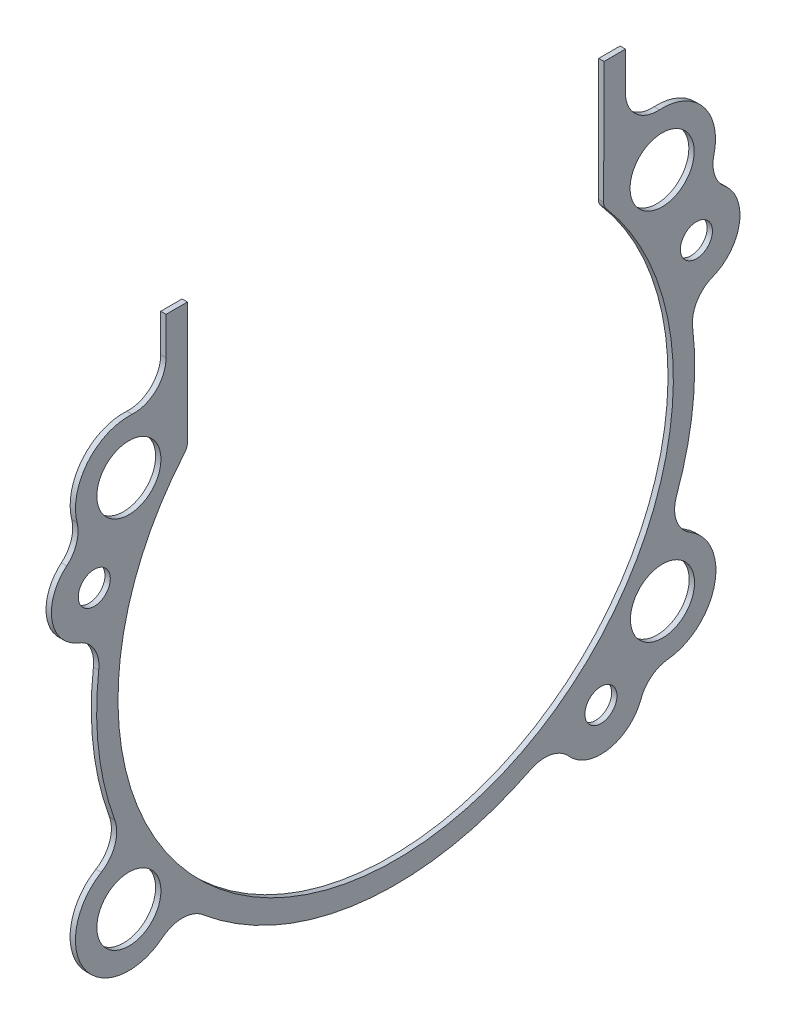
ISO-10303-21;
HEADER;
FILE_DESCRIPTION(('STEP AP214'),'2;1');
FILE_NAME('part.step','',(''),(''),'','','');
FILE_SCHEMA(('AUTOMOTIVE_DESIGN { 1 0 10303 214 1 1 1 1 }'));
ENDSEC;
DATA;
#1=APPLICATION_CONTEXT('core data for automotive mechanical design processes');
#2=APPLICATION_PROTOCOL_DEFINITION('international standard','automotive_design',2000,#1);
#3=PRODUCT_CONTEXT('',#1,'mechanical');
#4=PRODUCT('Part','Part','',(#3));
#5=PRODUCT_RELATED_PRODUCT_CATEGORY('part','',(#4));
#6=PRODUCT_DEFINITION_FORMATION('','',#4);
#7=PRODUCT_DEFINITION_CONTEXT('part definition',#1,'design');
#8=PRODUCT_DEFINITION('design','',#6,#7);
#9=PRODUCT_DEFINITION_SHAPE('','',#8);
#10=(LENGTH_UNIT() NAMED_UNIT(*) SI_UNIT(.MILLI.,.METRE.));
#11=(NAMED_UNIT(*) PLANE_ANGLE_UNIT() SI_UNIT($,.RADIAN.));
#12=(NAMED_UNIT(*) SI_UNIT($,.STERADIAN.) SOLID_ANGLE_UNIT());
#13=UNCERTAINTY_MEASURE_WITH_UNIT(LENGTH_MEASURE(1.E-05),#10,'distance_accuracy_value','');
#14=(GEOMETRIC_REPRESENTATION_CONTEXT(3) GLOBAL_UNCERTAINTY_ASSIGNED_CONTEXT((#13)) GLOBAL_UNIT_ASSIGNED_CONTEXT((#10,
#11,#12)) REPRESENTATION_CONTEXT('',''));
#15=CARTESIAN_POINT('',(0.,0.,0.));
#16=DIRECTION('',(0.,0.,1.));
#17=DIRECTION('',(1.,0.,0.));
#18=AXIS2_PLACEMENT_3D('',#15,#16,#17);
#19=CARTESIAN_POINT('',(-0.25,0.,0.));
#20=DIRECTION('',(1.,0.,0.));
#21=DIRECTION('',(0.,0.,-1.));
#22=AXIS2_PLACEMENT_3D('',#19,#20,#21);
#23=PLANE('',#22);
#24=CARTESIAN_POINT('',(-0.25,10.18,28.22));
#25=DIRECTION('',(1.,0.,0.));
#26=DIRECTION('',(0.,0.,-1.));
#27=AXIS2_PLACEMENT_3D('',#24,#25,#26);
#28=CIRCLE('',#27,1.5);
#29=CARTESIAN_POINT('',(-0.25,10.18,26.72));
#30=VERTEX_POINT('',#29);
#31=EDGE_CURVE('E357',#30,#30,#28,.T.);
#32=ORIENTED_EDGE('',*,*,#31,.T.);
#33=EDGE_LOOP('',(#32));
#34=FACE_BOUND('',#33,.T.);
#35=CARTESIAN_POINT('',(-0.25,-23.04,-19.22));
#36=DIRECTION('',(1.,0.,0.));
#37=DIRECTION('',(0.,0.,-1.));
#38=AXIS2_PLACEMENT_3D('',#35,#36,#37);
#39=CIRCLE('',#38,1.5);
#40=CARTESIAN_POINT('',(-0.25,-23.04,-20.72));
#41=VERTEX_POINT('',#40);
#42=EDGE_CURVE('E360',#41,#41,#39,.T.);
#43=ORIENTED_EDGE('',*,*,#42,.T.);
#44=EDGE_LOOP('',(#43));
#45=FACE_BOUND('',#44,.T.);
#46=CARTESIAN_POINT('',(-0.25,10.18,-28.16019617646));
#47=DIRECTION('',(1.,0.,0.));
#48=DIRECTION('',(0.,0.,-1.));
#49=AXIS2_PLACEMENT_3D('',#46,#47,#48);
#50=CIRCLE('',#49,1.5);
#51=CARTESIAN_POINT('',(-0.25,10.18,-29.66019617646));
#52=VERTEX_POINT('',#51);
#53=EDGE_CURVE('E363',#52,#52,#50,.T.);
#54=ORIENTED_EDGE('',*,*,#53,.T.);
#55=EDGE_LOOP('',(#54));
#56=FACE_BOUND('',#55,.T.);
#57=CARTESIAN_POINT('',(-0.25,-17.49,-24.98));
#58=DIRECTION('',(1.,0.,0.));
#59=DIRECTION('',(0.,0.,-1.));
#60=AXIS2_PLACEMENT_3D('',#57,#58,#59);
#61=CIRCLE('',#60,3.);
#62=CARTESIAN_POINT('',(-0.25,-17.49,-27.98));
#63=VERTEX_POINT('',#62);
#64=EDGE_CURVE('E366',#63,#63,#61,.T.);
#65=ORIENTED_EDGE('',*,*,#64,.T.);
#66=EDGE_LOOP('',(#65));
#67=FACE_BOUND('',#66,.T.);
#68=CARTESIAN_POINT('',(-0.25,-17.49,24.98));
#69=DIRECTION('',(1.,0.,0.));
#70=DIRECTION('',(0.,0.,-1.));
#71=AXIS2_PLACEMENT_3D('',#68,#69,#70);
#72=CIRCLE('',#71,3.);
#73=CARTESIAN_POINT('',(-0.25,-17.49,21.98));
#74=VERTEX_POINT('',#73);
#75=EDGE_CURVE('E369',#74,#74,#72,.T.);
#76=ORIENTED_EDGE('',*,*,#75,.T.);
#77=EDGE_LOOP('',(#76));
#78=FACE_BOUND('',#77,.T.);
#79=CARTESIAN_POINT('',(-0.25,17.49,24.98));
#80=DIRECTION('',(1.,0.,0.));
#81=DIRECTION('',(0.,0.,-1.));
#82=AXIS2_PLACEMENT_3D('',#79,#80,#81);
#83=CIRCLE('',#82,3.);
#84=CARTESIAN_POINT('',(-0.25,17.49,21.98));
#85=VERTEX_POINT('',#84);
#86=EDGE_CURVE('E372',#85,#85,#83,.T.);
#87=ORIENTED_EDGE('',*,*,#86,.T.);
#88=EDGE_LOOP('',(#87));
#89=FACE_BOUND('',#88,.T.);
#90=CARTESIAN_POINT('',(-0.25,17.49,-24.94873879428));
#91=DIRECTION('',(1.,0.,0.));
#92=DIRECTION('',(0.,0.,-1.));
#93=AXIS2_PLACEMENT_3D('',#90,#91,#92);
#94=CIRCLE('',#93,3.);
#95=CARTESIAN_POINT('',(-0.25,17.49,-27.94873879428));
#96=VERTEX_POINT('',#95);
#97=EDGE_CURVE('E375',#96,#96,#94,.T.);
#98=ORIENTED_EDGE('',*,*,#97,.T.);
#99=EDGE_LOOP('',(#98));
#100=FACE_BOUND('',#99,.T.);
#101=DIRECTION('',(0.,0.,1.));
#102=VECTOR('',#101,1.);
#103=CARTESIAN_POINT('',(-0.25,29.,-21.51367783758));
#104=LINE('',#103,#102);
#105=CARTESIAN_POINT('',(-0.25,29.,-21.5136778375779));
#106=VERTEX_POINT('',#105);
#107=CARTESIAN_POINT('',(-0.25,29.,-19.51367783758));
#108=VERTEX_POINT('',#107);
#109=EDGE_CURVE('E270',#106,#108,#104,.T.);
#110=ORIENTED_EDGE('',*,*,#109,.F.);
#111=DIRECTION('',(0.,0.999999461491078,-0.00103779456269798));
#112=VECTOR('',#111,1.);
#113=CARTESIAN_POINT('',(-0.25,25.48,-21.51002479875));
#114=LINE('',#113,#112);
#115=CARTESIAN_POINT('',(-0.25,25.4771524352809,-21.5100239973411));
#116=VERTEX_POINT('',#115);
#117=EDGE_CURVE('E385',#116,#106,#114,.T.);
#118=ORIENTED_EDGE('',*,*,#117,.F.);
#119=CARTESIAN_POINT('',(-0.25,25.48,-24.51002479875));
#120=DIRECTION('',(1.,0.,0.));
#121=DIRECTION('',(0.,0.,-1.));
#122=AXIS2_PLACEMENT_3D('',#119,#120,#121);
#123=CIRCLE('',#122,3.);
#124=CARTESIAN_POINT('',(-0.25,22.4852195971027,-24.6869155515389));
#125=VERTEX_POINT('',#124);
#126=EDGE_CURVE('E388',#116,#125,#123,.T.);
#127=ORIENTED_EDGE('',*,*,#126,.T.);
#128=CARTESIAN_POINT('',(-0.25,17.49207987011,-24.94874692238));
#129=DIRECTION('',(1.,0.,0.));
#130=DIRECTION('',(0.,0.,-1.));
#131=AXIS2_PLACEMENT_3D('',#128,#129,#130);
#132=CIRCLE('',#131,5.);
#133=CARTESIAN_POINT('',(-0.25,16.2576109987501,-29.7939596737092));
#134=VERTEX_POINT('',#133);
#135=EDGE_CURVE('E391',#134,#125,#132,.T.);
#136=ORIENTED_EDGE('',*,*,#135,.F.);
#137=CARTESIAN_POINT('',(-0.25,15.56084418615,-32.71192403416));
#138=DIRECTION('',(1.,0.,0.));
#139=DIRECTION('',(0.,0.,-1.));
#140=AXIS2_PLACEMENT_3D('',#137,#138,#139);
#141=CIRCLE('',#140,3.);
#142=CARTESIAN_POINT('',(-0.25,13.2892510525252,-30.7523667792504));
#143=VERTEX_POINT('',#142);
#144=EDGE_CURVE('E395',#134,#143,#141,.T.);
#145=ORIENTED_EDGE('',*,*,#144,.T.);
#146=CARTESIAN_POINT('',(-0.25,10.18,-28.23590937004));
#147=DIRECTION('',(1.,0.,0.));
#148=DIRECTION('',(0.,0.,-1.));
#149=AXIS2_PLACEMENT_3D('',#146,#147,#148);
#150=CIRCLE('',#149,4.);
#151=CARTESIAN_POINT('',(-0.25,6.45999999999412,-29.7061474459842));
#152=VERTEX_POINT('',#151);
#153=EDGE_CURVE('E398',#152,#143,#150,.T.);
#154=ORIENTED_EDGE('',*,*,#153,.F.);
#155=CARTESIAN_POINT('',(-0.25,3.66,-30.78318040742));
#156=DIRECTION('',(1.,0.,0.));
#157=DIRECTION('',(0.,0.,-1.));
#158=AXIS2_PLACEMENT_3D('',#155,#156,#157);
#159=CIRCLE('',#158,3.);
#160=CARTESIAN_POINT('',(-0.25,3.31000000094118,-27.8036670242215));
#161=VERTEX_POINT('',#160);
#162=EDGE_CURVE('E402',#152,#161,#159,.T.);
#163=ORIENTED_EDGE('',*,*,#162,.T.);
#164=CARTESIAN_POINT('',(-0.25,0.,0.));
#165=DIRECTION('',(1.,0.,0.));
#166=DIRECTION('',(0.,0.,-1.));
#167=AXIS2_PLACEMENT_3D('',#164,#165,#166);
#168=CIRCLE('',#167,28.);
#169=CARTESIAN_POINT('',(-0.25,-9.60999996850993,-26.2991996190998));
#170=VERTEX_POINT('',#169);
#171=EDGE_CURVE('E405',#170,#161,#168,.T.);
#172=ORIENTED_EDGE('',*,*,#171,.F.);
#173=CARTESIAN_POINT('',(-0.25,-10.64,-29.11684046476));
#174=DIRECTION('',(1.,0.,0.));
#175=DIRECTION('',(0.,0.,-1.));
#176=AXIS2_PLACEMENT_3D('',#173,#174,#175);
#177=CIRCLE('',#176,3.);
#178=CARTESIAN_POINT('',(-0.25,-13.2100000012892,-27.5692294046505));
#179=VERTEX_POINT('',#178);
#180=EDGE_CURVE('E409',#170,#179,#177,.T.);
#181=ORIENTED_EDGE('',*,*,#180,.T.);
#182=CARTESIAN_POINT('',(-0.25,-17.49,-24.98435029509));
#183=DIRECTION('',(1.,0.,0.));
#184=DIRECTION('',(0.,0.,-1.));
#185=AXIS2_PLACEMENT_3D('',#182,#183,#184);
#186=CIRCLE('',#185,5.);
#187=CARTESIAN_POINT('',(-0.25,-22.4699999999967,-25.4311164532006));
#188=VERTEX_POINT('',#187);
#189=EDGE_CURVE('E412',#188,#179,#186,.T.);
#190=ORIENTED_EDGE('',*,*,#189,.F.);
#191=CARTESIAN_POINT('',(-0.25,-25.44796548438,-25.79405112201));
#192=DIRECTION('',(1.,0.,0.));
#193=DIRECTION('',(0.,0.,-1.));
#194=AXIS2_PLACEMENT_3D('',#191,#192,#193);
#195=CIRCLE('',#194,3.);
#196=CARTESIAN_POINT('',(-0.25,-24.435673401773,-22.9700000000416));
#197=VERTEX_POINT('',#196);
#198=EDGE_CURVE('E416',#188,#197,#195,.T.);
#199=ORIENTED_EDGE('',*,*,#198,.T.);
#200=CARTESIAN_POINT('',(-0.25,-23.04373231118,-19.22));
#201=DIRECTION('',(1.,0.,0.));
#202=DIRECTION('',(0.,0.,-1.));
#203=AXIS2_PLACEMENT_3D('',#200,#201,#202);
#204=CIRCLE('',#203,4.);
#205=CARTESIAN_POINT('',(-0.25,-25.6894836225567,-16.2200000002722));
#206=VERTEX_POINT('',#205);
#207=EDGE_CURVE('E419',#206,#197,#204,.T.);
#208=ORIENTED_EDGE('',*,*,#207,.F.);
#209=CARTESIAN_POINT('',(-0.25,-27.67379710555,-13.97));
#210=DIRECTION('',(1.,0.,0.));
#211=DIRECTION('',(0.,0.,-1.));
#212=AXIS2_PLACEMENT_3D('',#209,#210,#211);
#213=CIRCLE('',#212,3.);
#214=CARTESIAN_POINT('',(-0.25,-24.9947114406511,-12.6199999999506));
#215=VERTEX_POINT('',#214);
#216=EDGE_CURVE('E423',#206,#215,#213,.T.);
#217=ORIENTED_EDGE('',*,*,#216,.T.);
#218=CARTESIAN_POINT('',(-0.25,0.,0.));
#219=DIRECTION('',(1.,0.,0.));
#220=DIRECTION('',(0.,0.,-1.));
#221=AXIS2_PLACEMENT_3D('',#218,#219,#220);
#222=CIRCLE('',#221,28.);
#223=CARTESIAN_POINT('',(-0.25,-21.4223971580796,18.0300000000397));
#224=VERTEX_POINT('',#223);
#225=EDGE_CURVE('E426',#224,#215,#222,.T.);
#226=ORIENTED_EDGE('',*,*,#225,.F.);
#227=CARTESIAN_POINT('',(-0.25,-23.71722268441,19.96229806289));
#228=DIRECTION('',(1.,0.,0.));
#229=DIRECTION('',(0.,0.,-1.));
#230=AXIS2_PLACEMENT_3D('',#227,#228,#229);
#231=CIRCLE('',#230,3.);
#232=CARTESIAN_POINT('',(-0.25,-21.3900000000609,21.8554527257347));
#233=VERTEX_POINT('',#232);
#234=EDGE_CURVE('E430',#224,#233,#231,.T.);
#235=ORIENTED_EDGE('',*,*,#234,.T.);
#236=CARTESIAN_POINT('',(-0.25,-17.49,24.98435029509));
#237=DIRECTION('',(1.,0.,0.));
#238=DIRECTION('',(0.,0.,-1.));
#239=AXIS2_PLACEMENT_3D('',#236,#237,#238);
#240=CIRCLE('',#239,5.);
#241=CARTESIAN_POINT('',(-0.25,-13.2100000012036,27.5692294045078));
#242=VERTEX_POINT('',#241);
#243=EDGE_CURVE('E433',#242,#233,#240,.T.);
#244=ORIENTED_EDGE('',*,*,#243,.F.);
#245=CARTESIAN_POINT('',(-0.25,-10.64,29.11684046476));
#246=DIRECTION('',(1.,0.,0.));
#247=DIRECTION('',(0.,0.,-1.));
#248=AXIS2_PLACEMENT_3D('',#245,#246,#247);
#249=CIRCLE('',#248,3.);
#250=CARTESIAN_POINT('',(-0.25,-9.60999996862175,26.2991996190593));
#251=VERTEX_POINT('',#250);
#252=EDGE_CURVE('E437',#242,#251,#249,.T.);
#253=ORIENTED_EDGE('',*,*,#252,.T.);
#254=CARTESIAN_POINT('',(-0.25,0.,0.));
#255=DIRECTION('',(1.,0.,0.));
#256=DIRECTION('',(0.,0.,-1.));
#257=AXIS2_PLACEMENT_3D('',#254,#255,#256);
#258=CIRCLE('',#257,28.);
#259=CARTESIAN_POINT('',(-0.25,3.31000000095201,27.8036670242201));
#260=VERTEX_POINT('',#259);
#261=EDGE_CURVE('E440',#260,#251,#258,.T.);
#262=ORIENTED_EDGE('',*,*,#261,.F.);
#263=CARTESIAN_POINT('',(-0.25,3.66,30.78318040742));
#264=DIRECTION('',(1.,0.,0.));
#265=DIRECTION('',(0.,0.,-1.));
#266=AXIS2_PLACEMENT_3D('',#263,#264,#265);
#267=CIRCLE('',#266,3.);
#268=CARTESIAN_POINT('',(-0.25,6.46000000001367,29.7061474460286));
#269=VERTEX_POINT('',#268);
#270=EDGE_CURVE('E444',#260,#269,#267,.T.);
#271=ORIENTED_EDGE('',*,*,#270,.T.);
#272=CARTESIAN_POINT('',(-0.25,10.18,28.23590937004));
#273=DIRECTION('',(1.,0.,0.));
#274=DIRECTION('',(0.,0.,-1.));
#275=AXIS2_PLACEMENT_3D('',#272,#273,#274);
#276=CIRCLE('',#275,4.);
#277=CARTESIAN_POINT('',(-0.25,13.2500878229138,30.8000000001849));
#278=VERTEX_POINT('',#277);
#279=EDGE_CURVE('E447',#278,#269,#276,.T.);
#280=ORIENTED_EDGE('',*,*,#279,.F.);
#281=CARTESIAN_POINT('',(-0.25,15.54037216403,32.73767841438));
#282=DIRECTION('',(1.,0.,0.));
#283=DIRECTION('',(0.,0.,-1.));
#284=AXIS2_PLACEMENT_3D('',#281,#282,#283);
#285=CIRCLE('',#284,3.);
#286=CARTESIAN_POINT('',(-0.25,16.2788884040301,29.8299999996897));
#287=VERTEX_POINT('',#286);
#288=EDGE_CURVE('E451',#278,#287,#285,.T.);
#289=ORIENTED_EDGE('',*,*,#288,.T.);
#290=CARTESIAN_POINT('',(-0.25,17.49441298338,24.98));
#291=DIRECTION('',(1.,0.,0.));
#292=DIRECTION('',(0.,0.,-1.));
#293=AXIS2_PLACEMENT_3D('',#290,#291,#292);
#294=CIRCLE('',#293,5.);
#295=CARTESIAN_POINT('',(-0.25,22.4854048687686,24.68000000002));
#296=VERTEX_POINT('',#295);
#297=EDGE_CURVE('E454',#296,#287,#294,.T.);
#298=ORIENTED_EDGE('',*,*,#297,.F.);
#299=CARTESIAN_POINT('',(-0.25,25.48,24.5));
#300=DIRECTION('',(1.,0.,0.));
#301=DIRECTION('',(0.,0.,-1.));
#302=AXIS2_PLACEMENT_3D('',#299,#300,#301);
#303=CIRCLE('',#302,3.);
#304=CARTESIAN_POINT('',(-0.25,25.48,21.5));
#305=VERTEX_POINT('',#304);
#306=EDGE_CURVE('E274',#296,#305,#303,.T.);
#307=ORIENTED_EDGE('',*,*,#306,.T.);
#308=DIRECTION('',(0.,1.,0.));
#309=VECTOR('',#308,1.);
#310=CARTESIAN_POINT('',(-0.25,29.,21.5));
#311=LINE('',#310,#309);
#312=CARTESIAN_POINT('',(-0.25,29.,21.5));
#313=VERTEX_POINT('',#312);
#314=EDGE_CURVE('E232',#313,#305,#311,.F.);
#315=ORIENTED_EDGE('',*,*,#314,.F.);
#316=DIRECTION('',(0.,0.,1.));
#317=VECTOR('',#316,1.);
#318=CARTESIAN_POINT('',(-0.25,29.,19.5));
#319=LINE('',#318,#317);
#320=CARTESIAN_POINT('',(-0.25,29.,19.5));
#321=VERTEX_POINT('',#320);
#322=EDGE_CURVE('E228',#321,#313,#319,.T.);
#323=ORIENTED_EDGE('',*,*,#322,.F.);
#324=DIRECTION('',(0.,1.,0.));
#325=VECTOR('',#324,1.);
#326=CARTESIAN_POINT('',(-0.25,26.5,19.5));
#327=LINE('',#326,#325);
#328=CARTESIAN_POINT('',(-0.25,17.57128235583,19.5));
#329=VERTEX_POINT('',#328);
#330=EDGE_CURVE('E257',#329,#321,#327,.T.);
#331=ORIENTED_EDGE('',*,*,#330,.F.);
#332=CARTESIAN_POINT('',(-0.25,17.57128235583,20.5));
#333=DIRECTION('',(1.,0.,0.));
#334=DIRECTION('',(0.,0.,-1.));
#335=AXIS2_PLACEMENT_3D('',#332,#333,#334);
#336=CIRCLE('',#335,1.);
#337=CARTESIAN_POINT('',(-0.25,16.9213592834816,19.7399999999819));
#338=VERTEX_POINT('',#337);
#339=EDGE_CURVE('E263',#338,#329,#336,.T.);
#340=ORIENTED_EDGE('',*,*,#339,.F.);
#341=CARTESIAN_POINT('',(-0.25,0.,0.));
#342=DIRECTION('',(1.,0.,0.));
#343=DIRECTION('',(0.,0.,-1.));
#344=AXIS2_PLACEMENT_3D('',#341,#342,#343);
#345=CIRCLE('',#344,26.);
#346=CARTESIAN_POINT('',(-0.25,16.9602122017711,-19.7066283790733));
#347=VERTEX_POINT('',#346);
#348=EDGE_CURVE('E269',#338,#347,#345,.T.);
#349=ORIENTED_EDGE('',*,*,#348,.T.);
#350=CARTESIAN_POINT('',(-0.25,17.60716922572,-20.46915484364));
#351=DIRECTION('',(1.,0.,0.));
#352=DIRECTION('',(0.,0.,-1.));
#353=AXIS2_PLACEMENT_3D('',#350,#351,#352);
#354=CIRCLE('',#353,1.);
#355=CARTESIAN_POINT('',(-0.25,17.60716922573,-19.4691548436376));
#356=VERTEX_POINT('',#355);
#357=EDGE_CURVE('E20',#356,#347,#354,.T.);
#358=ORIENTED_EDGE('',*,*,#357,.F.);
#359=DIRECTION('',(0.,-0.999992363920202,0.00390795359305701));
#360=VECTOR('',#359,1.);
#361=CARTESIAN_POINT('',(-0.25,25.50002672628,-19.5));
#362=LINE('',#361,#360);
#363=EDGE_CURVE('E378',#108,#356,#362,.T.);
#364=ORIENTED_EDGE('',*,*,#363,.F.);
#365=EDGE_LOOP('',(#110,#118,#127,#136,#145,#154,#163,#172,#181,#190,#199,#208,#217,#226,#235,
#244,#253,#262,#271,#280,#289,#298,#307,#315,#323,#331,#340,#349,#358,#364));
#366=FACE_BOUND('',#365,.T.);
#367=ADVANCED_FACE('F16',(#34,#45,#56,#67,#78,#89,#100,#366),#23,.F.);
#368=CARTESIAN_POINT('',(-0.25,17.60716922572,-20.46915484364));
#369=DIRECTION('',(1.,0.,0.));
#370=DIRECTION('',(0.,0.,-1.));
#371=AXIS2_PLACEMENT_3D('',#368,#369,#370);
#372=CYLINDRICAL_SURFACE('',#371,1.);
#373=DIRECTION('',(1.,0.,0.));
#374=VECTOR('',#373,1.);
#375=CARTESIAN_POINT('',(-0.25,17.60716922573,-19.4691548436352));
#376=LINE('',#375,#374);
#377=CARTESIAN_POINT('',(0.25,17.60716922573,-19.4691548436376));
#378=VERTEX_POINT('',#377);
#379=EDGE_CURVE('E381',#356,#378,#376,.T.);
#380=ORIENTED_EDGE('',*,*,#379,.F.);
#381=ORIENTED_EDGE('',*,*,#357,.T.);
#382=DIRECTION('',(1.,0.,0.));
#383=VECTOR('',#382,1.);
#384=CARTESIAN_POINT('',(-0.25,16.9602122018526,-19.7066283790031));
#385=LINE('',#384,#383);
#386=CARTESIAN_POINT('',(0.25,16.9602122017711,-19.7066283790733));
#387=VERTEX_POINT('',#386);
#388=EDGE_CURVE('E267',#347,#387,#385,.T.);
#389=ORIENTED_EDGE('',*,*,#388,.T.);
#390=CARTESIAN_POINT('',(0.25,17.60716922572,-20.46915484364));
#391=DIRECTION('',(1.,0.,0.));
#392=DIRECTION('',(0.,0.,-1.));
#393=AXIS2_PLACEMENT_3D('',#390,#391,#392);
#394=CIRCLE('',#393,1.);
#395=EDGE_CURVE('E355',#378,#387,#394,.T.);
#396=ORIENTED_EDGE('',*,*,#395,.F.);
#397=EDGE_LOOP('',(#380,#381,#389,#396));
#398=FACE_BOUND('',#397,.T.);
#399=ADVANCED_FACE('F463',(#398),#372,.T.);
#400=CARTESIAN_POINT('',(-0.25,0.,0.));
#401=DIRECTION('',(1.,0.,0.));
#402=DIRECTION('',(0.,0.,-1.));
#403=AXIS2_PLACEMENT_3D('',#400,#401,#402);
#404=CYLINDRICAL_SURFACE('',#403,26.);
#405=DIRECTION('',(1.,0.,0.));
#406=VECTOR('',#405,1.);
#407=CARTESIAN_POINT('',(-0.25,16.9213592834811,19.7399999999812));
#408=LINE('',#407,#406);
#409=CARTESIAN_POINT('',(0.25,16.9213592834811,19.7399999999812));
#410=VERTEX_POINT('',#409);
#411=EDGE_CURVE('E264',#410,#338,#408,.F.);
#412=ORIENTED_EDGE('',*,*,#411,.F.);
#413=CARTESIAN_POINT('',(0.25,0.,0.));
#414=DIRECTION('',(1.,0.,0.));
#415=DIRECTION('',(0.,0.,-1.));
#416=AXIS2_PLACEMENT_3D('',#413,#414,#415);
#417=CIRCLE('',#416,26.);
#418=EDGE_CURVE('E353',#387,#410,#417,.F.);
#419=ORIENTED_EDGE('',*,*,#418,.F.);
#420=ORIENTED_EDGE('',*,*,#388,.F.);
#421=ORIENTED_EDGE('',*,*,#348,.F.);
#422=EDGE_LOOP('',(#412,#419,#420,#421));
#423=FACE_BOUND('',#422,.T.);
#424=ADVANCED_FACE('F468',(#423),#404,.F.);
#425=CARTESIAN_POINT('',(-0.25,17.57128235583,20.5));
#426=DIRECTION('',(1.,0.,0.));
#427=DIRECTION('',(0.,0.,-1.));
#428=AXIS2_PLACEMENT_3D('',#425,#426,#427);
#429=CYLINDRICAL_SURFACE('',#428,1.);
#430=ORIENTED_EDGE('',*,*,#411,.T.);
#431=ORIENTED_EDGE('',*,*,#339,.T.);
#432=DIRECTION('',(-1.,0.,0.));
#433=VECTOR('',#432,1.);
#434=CARTESIAN_POINT('',(-0.25,17.57128235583,19.5));
#435=LINE('',#434,#433);
#436=CARTESIAN_POINT('',(0.25,17.57128235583,19.5));
#437=VERTEX_POINT('',#436);
#438=EDGE_CURVE('E260',#437,#329,#435,.T.);
#439=ORIENTED_EDGE('',*,*,#438,.F.);
#440=CARTESIAN_POINT('',(0.25,17.57128235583,20.5));
#441=DIRECTION('',(1.,0.,0.));
#442=DIRECTION('',(0.,0.,-1.));
#443=AXIS2_PLACEMENT_3D('',#440,#441,#442);
#444=CIRCLE('',#443,1.);
#445=EDGE_CURVE('E248',#410,#437,#444,.T.);
#446=ORIENTED_EDGE('',*,*,#445,.F.);
#447=EDGE_LOOP('',(#430,#431,#439,#446));
#448=FACE_BOUND('',#447,.T.);
#449=ADVANCED_FACE('F660',(#448),#429,.T.);
#450=CARTESIAN_POINT('',(-0.25,26.5,19.5));
#451=DIRECTION('',(0.,0.,-1.));
#452=DIRECTION('',(-1.,0.,0.));
#453=AXIS2_PLACEMENT_3D('',#450,#451,#452);
#454=PLANE('',#453);
#455=DIRECTION('',(1.,0.,0.));
#456=VECTOR('',#455,1.);
#457=CARTESIAN_POINT('',(-0.25,29.,19.5));
#458=LINE('',#457,#456);
#459=CARTESIAN_POINT('',(0.25,29.,19.5));
#460=VERTEX_POINT('',#459);
#461=EDGE_CURVE('E255',#460,#321,#458,.F.);
#462=ORIENTED_EDGE('',*,*,#461,.F.);
#463=DIRECTION('',(0.,1.,0.));
#464=VECTOR('',#463,1.);
#465=CARTESIAN_POINT('',(0.25,0.,19.5));
#466=LINE('',#465,#464);
#467=EDGE_CURVE('E245',#437,#460,#466,.T.);
#468=ORIENTED_EDGE('',*,*,#467,.F.);
#469=ORIENTED_EDGE('',*,*,#438,.T.);
#470=ORIENTED_EDGE('',*,*,#330,.T.);
#471=EDGE_LOOP('',(#462,#468,#469,#470));
#472=FACE_BOUND('',#471,.T.);
#473=ADVANCED_FACE('F663',(#472),#454,.T.);
#474=CARTESIAN_POINT('',(-0.25,29.,19.5));
#475=DIRECTION('',(0.,1.,0.));
#476=DIRECTION('',(0.,0.,1.));
#477=AXIS2_PLACEMENT_3D('',#474,#475,#476);
#478=PLANE('',#477);
#479=ORIENTED_EDGE('',*,*,#461,.T.);
#480=ORIENTED_EDGE('',*,*,#322,.T.);
#481=DIRECTION('',(1.,0.,0.));
#482=VECTOR('',#481,1.);
#483=CARTESIAN_POINT('',(-0.25,29.,21.5));
#484=LINE('',#483,#482);
#485=CARTESIAN_POINT('',(0.25,29.,21.5));
#486=VERTEX_POINT('',#485);
#487=EDGE_CURVE('E221',#486,#313,#484,.F.);
#488=ORIENTED_EDGE('',*,*,#487,.F.);
#489=DIRECTION('',(0.,0.,-1.));
#490=VECTOR('',#489,1.);
#491=CARTESIAN_POINT('',(0.25,29.,0.));
#492=LINE('',#491,#490);
#493=EDGE_CURVE('E226',#460,#486,#492,.F.);
#494=ORIENTED_EDGE('',*,*,#493,.F.);
#495=EDGE_LOOP('',(#479,#480,#488,#494));
#496=FACE_BOUND('',#495,.T.);
#497=ADVANCED_FACE('F224',(#496),#478,.T.);
#498=CARTESIAN_POINT('',(-0.25,29.,21.5));
#499=DIRECTION('',(0.,0.,1.));
#500=DIRECTION('',(1.,0.,0.));
#501=AXIS2_PLACEMENT_3D('',#498,#499,#500);
#502=PLANE('',#501);
#503=ORIENTED_EDGE('',*,*,#487,.T.);
#504=ORIENTED_EDGE('',*,*,#314,.T.);
#505=DIRECTION('',(1.,0.,0.));
#506=VECTOR('',#505,1.);
#507=CARTESIAN_POINT('',(-0.25,25.48,21.5));
#508=LINE('',#507,#506);
#509=CARTESIAN_POINT('',(0.25,25.48,21.5));
#510=VERTEX_POINT('',#509);
#511=EDGE_CURVE('E238',#305,#510,#508,.T.);
#512=ORIENTED_EDGE('',*,*,#511,.T.);
#513=DIRECTION('',(0.,1.,0.));
#514=VECTOR('',#513,1.);
#515=CARTESIAN_POINT('',(0.25,0.,21.5));
#516=LINE('',#515,#514);
#517=EDGE_CURVE('E235',#486,#510,#516,.F.);
#518=ORIENTED_EDGE('',*,*,#517,.F.);
#519=EDGE_LOOP('',(#503,#504,#512,#518));
#520=FACE_BOUND('',#519,.T.);
#521=ADVANCED_FACE('F236',(#520),#502,.T.);
#522=CARTESIAN_POINT('',(-0.25,25.48,24.5));
#523=DIRECTION('',(1.,0.,0.));
#524=DIRECTION('',(0.,0.,-1.));
#525=AXIS2_PLACEMENT_3D('',#522,#523,#524);
#526=CYLINDRICAL_SURFACE('',#525,3.);
#527=CARTESIAN_POINT('',(0.25,25.48,24.5));
#528=DIRECTION('',(1.,0.,0.));
#529=DIRECTION('',(0.,0.,-1.));
#530=AXIS2_PLACEMENT_3D('',#527,#528,#529);
#531=CIRCLE('',#530,3.);
#532=CARTESIAN_POINT('',(0.25,22.4854048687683,24.68000000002));
#533=VERTEX_POINT('',#532);
#534=EDGE_CURVE('E241',#510,#533,#531,.F.);
#535=ORIENTED_EDGE('',*,*,#534,.F.);
#536=ORIENTED_EDGE('',*,*,#511,.F.);
#537=ORIENTED_EDGE('',*,*,#306,.F.);
#538=DIRECTION('',(1.,0.,0.));
#539=VECTOR('',#538,1.);
#540=CARTESIAN_POINT('',(-0.25,22.4854048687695,24.68000000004));
#541=LINE('',#540,#539);
#542=EDGE_CURVE('E457',#533,#296,#541,.F.);
#543=ORIENTED_EDGE('',*,*,#542,.F.);
#544=EDGE_LOOP('',(#535,#536,#537,#543));
#545=FACE_BOUND('',#544,.T.);
#546=ADVANCED_FACE('F523',(#545),#526,.F.);
#547=CARTESIAN_POINT('',(-0.25,17.49441298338,24.98));
#548=DIRECTION('',(1.,0.,0.));
#549=DIRECTION('',(0.,0.,-1.));
#550=AXIS2_PLACEMENT_3D('',#547,#548,#549);
#551=CYLINDRICAL_SURFACE('',#550,5.);
#552=ORIENTED_EDGE('',*,*,#542,.T.);
#553=ORIENTED_EDGE('',*,*,#297,.T.);
#554=DIRECTION('',(1.,0.,0.));
#555=VECTOR('',#554,1.);
#556=CARTESIAN_POINT('',(-0.25,16.2788884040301,29.8299999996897));
#557=LINE('',#556,#555);
#558=CARTESIAN_POINT('',(0.25,16.27888840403,29.82999999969));
#559=VERTEX_POINT('',#558);
#560=EDGE_CURVE('E453',#287,#559,#557,.T.);
#561=ORIENTED_EDGE('',*,*,#560,.T.);
#562=CARTESIAN_POINT('',(0.25,17.49441298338,24.98));
#563=DIRECTION('',(1.,0.,0.));
#564=DIRECTION('',(0.,0.,-1.));
#565=AXIS2_PLACEMENT_3D('',#562,#563,#564);
#566=CIRCLE('',#565,5.);
#567=EDGE_CURVE('E349',#533,#559,#566,.T.);
#568=ORIENTED_EDGE('',*,*,#567,.F.);
#569=EDGE_LOOP('',(#552,#553,#561,#568));
#570=FACE_BOUND('',#569,.T.);
#571=ADVANCED_FACE('F519',(#570),#551,.T.);
#572=CARTESIAN_POINT('',(-0.25,15.54037216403,32.73767841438));
#573=DIRECTION('',(1.,0.,0.));
#574=DIRECTION('',(0.,0.,-1.));
#575=AXIS2_PLACEMENT_3D('',#572,#573,#574);
#576=CYLINDRICAL_SURFACE('',#575,3.);
#577=DIRECTION('',(1.,0.,0.));
#578=VECTOR('',#577,1.);
#579=CARTESIAN_POINT('',(-0.25,13.2500878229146,30.8000000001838));
#580=LINE('',#579,#578);
#581=CARTESIAN_POINT('',(0.25,13.2500878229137,30.8000000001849));
#582=VERTEX_POINT('',#581);
#583=EDGE_CURVE('E450',#582,#278,#580,.F.);
#584=ORIENTED_EDGE('',*,*,#583,.F.);
#585=CARTESIAN_POINT('',(0.25,15.54037216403,32.73767841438));
#586=DIRECTION('',(1.,0.,0.));
#587=DIRECTION('',(0.,0.,-1.));
#588=AXIS2_PLACEMENT_3D('',#585,#586,#587);
#589=CIRCLE('',#588,3.);
#590=EDGE_CURVE('E347',#559,#582,#589,.F.);
#591=ORIENTED_EDGE('',*,*,#590,.F.);
#592=ORIENTED_EDGE('',*,*,#560,.F.);
#593=ORIENTED_EDGE('',*,*,#288,.F.);
#594=EDGE_LOOP('',(#584,#591,#592,#593));
#595=FACE_BOUND('',#594,.T.);
#596=ADVANCED_FACE('F528',(#595),#576,.F.);
#597=CARTESIAN_POINT('',(-0.25,10.18,28.23590937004));
#598=DIRECTION('',(1.,0.,0.));
#599=DIRECTION('',(0.,0.,-1.));
#600=AXIS2_PLACEMENT_3D('',#597,#598,#599);
#601=CYLINDRICAL_SURFACE('',#600,4.);
#602=ORIENTED_EDGE('',*,*,#583,.T.);
#603=ORIENTED_EDGE('',*,*,#279,.T.);
#604=DIRECTION('',(1.,0.,0.));
#605=VECTOR('',#604,1.);
#606=CARTESIAN_POINT('',(-0.25,6.45999999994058,29.7061474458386));
#607=LINE('',#606,#605);
#608=CARTESIAN_POINT('',(0.25,6.46000000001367,29.7061474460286));
#609=VERTEX_POINT('',#608);
#610=EDGE_CURVE('E446',#269,#609,#607,.T.);
#611=ORIENTED_EDGE('',*,*,#610,.T.);
#612=CARTESIAN_POINT('',(0.25,10.18,28.23590937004));
#613=DIRECTION('',(1.,0.,0.));
#614=DIRECTION('',(0.,0.,-1.));
#615=AXIS2_PLACEMENT_3D('',#612,#613,#614);
#616=CIRCLE('',#615,4.);
#617=EDGE_CURVE('E345',#582,#609,#616,.T.);
#618=ORIENTED_EDGE('',*,*,#617,.F.);
#619=EDGE_LOOP('',(#602,#603,#611,#618));
#620=FACE_BOUND('',#619,.T.);
#621=ADVANCED_FACE('F535',(#620),#601,.T.);
#622=CARTESIAN_POINT('',(-0.25,3.66,30.78318040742));
#623=DIRECTION('',(1.,0.,0.));
#624=DIRECTION('',(0.,0.,-1.));
#625=AXIS2_PLACEMENT_3D('',#622,#623,#624);
#626=CYLINDRICAL_SURFACE('',#625,3.);
#627=DIRECTION('',(1.,0.,0.));
#628=VECTOR('',#627,1.);
#629=CARTESIAN_POINT('',(-0.25,3.310000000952,27.80366702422));
#630=LINE('',#629,#628);
#631=CARTESIAN_POINT('',(0.25,3.31000000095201,27.8036670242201));
#632=VERTEX_POINT('',#631);
#633=EDGE_CURVE('E443',#632,#260,#630,.F.);
#634=ORIENTED_EDGE('',*,*,#633,.F.);
#635=CARTESIAN_POINT('',(0.25,3.66,30.78318040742));
#636=DIRECTION('',(1.,0.,0.));
#637=DIRECTION('',(0.,0.,-1.));
#638=AXIS2_PLACEMENT_3D('',#635,#636,#637);
#639=CIRCLE('',#638,3.);
#640=EDGE_CURVE('E343',#609,#632,#639,.F.);
#641=ORIENTED_EDGE('',*,*,#640,.F.);
#642=ORIENTED_EDGE('',*,*,#610,.F.);
#643=ORIENTED_EDGE('',*,*,#270,.F.);
#644=EDGE_LOOP('',(#634,#641,#642,#643));
#645=FACE_BOUND('',#644,.T.);
#646=ADVANCED_FACE('F537',(#645),#626,.F.);
#647=CARTESIAN_POINT('',(-0.25,0.,0.));
#648=DIRECTION('',(1.,0.,0.));
#649=DIRECTION('',(0.,0.,-1.));
#650=AXIS2_PLACEMENT_3D('',#647,#648,#649);
#651=CYLINDRICAL_SURFACE('',#650,28.);
#652=ORIENTED_EDGE('',*,*,#633,.T.);
#653=ORIENTED_EDGE('',*,*,#261,.T.);
#654=DIRECTION('',(1.,0.,0.));
#655=VECTOR('',#654,1.);
#656=CARTESIAN_POINT('',(-0.25,-9.60999996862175,26.2991996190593));
#657=LINE('',#656,#655);
#658=CARTESIAN_POINT('',(0.25,-9.60999996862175,26.2991996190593));
#659=VERTEX_POINT('',#658);
#660=EDGE_CURVE('E439',#251,#659,#657,.T.);
#661=ORIENTED_EDGE('',*,*,#660,.T.);
#662=CARTESIAN_POINT('',(0.25,0.,0.));
#663=DIRECTION('',(1.,0.,0.));
#664=DIRECTION('',(0.,0.,-1.));
#665=AXIS2_PLACEMENT_3D('',#662,#663,#664);
#666=CIRCLE('',#665,28.);
#667=EDGE_CURVE('E341',#632,#659,#666,.T.);
#668=ORIENTED_EDGE('',*,*,#667,.F.);
#669=EDGE_LOOP('',(#652,#653,#661,#668));
#670=FACE_BOUND('',#669,.T.);
#671=ADVANCED_FACE('F541',(#670),#651,.T.);
#672=CARTESIAN_POINT('',(-0.25,-10.64,29.11684046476));
#673=DIRECTION('',(1.,0.,0.));
#674=DIRECTION('',(0.,0.,-1.));
#675=AXIS2_PLACEMENT_3D('',#672,#673,#674);
#676=CYLINDRICAL_SURFACE('',#675,3.);
#677=DIRECTION('',(1.,0.,0.));
#678=VECTOR('',#677,1.);
#679=CARTESIAN_POINT('',(-0.25,-13.2100000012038,27.5692294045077));
#680=LINE('',#679,#678);
#681=CARTESIAN_POINT('',(0.25,-13.2100000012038,27.5692294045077));
#682=VERTEX_POINT('',#681);
#683=EDGE_CURVE('E436',#682,#242,#680,.F.);
#684=ORIENTED_EDGE('',*,*,#683,.F.);
#685=CARTESIAN_POINT('',(0.25,-10.64,29.11684046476));
#686=DIRECTION('',(1.,0.,0.));
#687=DIRECTION('',(0.,0.,-1.));
#688=AXIS2_PLACEMENT_3D('',#685,#686,#687);
#689=CIRCLE('',#688,3.);
#690=EDGE_CURVE('E339',#659,#682,#689,.F.);
#691=ORIENTED_EDGE('',*,*,#690,.F.);
#692=ORIENTED_EDGE('',*,*,#660,.F.);
#693=ORIENTED_EDGE('',*,*,#252,.F.);
#694=EDGE_LOOP('',(#684,#691,#692,#693));
#695=FACE_BOUND('',#694,.T.);
#696=ADVANCED_FACE('F547',(#695),#676,.F.);
#697=CARTESIAN_POINT('',(-0.25,-17.49,24.98435029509));
#698=DIRECTION('',(1.,0.,0.));
#699=DIRECTION('',(0.,0.,-1.));
#700=AXIS2_PLACEMENT_3D('',#697,#698,#699);
#701=CYLINDRICAL_SURFACE('',#700,5.);
#702=ORIENTED_EDGE('',*,*,#683,.T.);
#703=ORIENTED_EDGE('',*,*,#243,.T.);
#704=DIRECTION('',(1.,0.,0.));
#705=VECTOR('',#704,1.);
#706=CARTESIAN_POINT('',(-0.25,-21.3899999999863,21.855452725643));
#707=LINE('',#706,#705);
#708=CARTESIAN_POINT('',(0.25,-21.3900000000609,21.8554527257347));
#709=VERTEX_POINT('',#708);
#710=EDGE_CURVE('E432',#233,#709,#707,.T.);
#711=ORIENTED_EDGE('',*,*,#710,.T.);
#712=CARTESIAN_POINT('',(0.25,-17.49,24.98435029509));
#713=DIRECTION('',(1.,0.,0.));
#714=DIRECTION('',(0.,0.,-1.));
#715=AXIS2_PLACEMENT_3D('',#712,#713,#714);
#716=CIRCLE('',#715,5.);
#717=EDGE_CURVE('E337',#682,#709,#716,.T.);
#718=ORIENTED_EDGE('',*,*,#717,.F.);
#719=EDGE_LOOP('',(#702,#703,#711,#718));
#720=FACE_BOUND('',#719,.T.);
#721=ADVANCED_FACE('F550',(#720),#701,.T.);
#722=CARTESIAN_POINT('',(-0.25,-23.71722268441,19.96229806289));
#723=DIRECTION('',(1.,0.,0.));
#724=DIRECTION('',(0.,0.,-1.));
#725=AXIS2_PLACEMENT_3D('',#722,#723,#724);
#726=CYLINDRICAL_SURFACE('',#725,3.);
#727=CARTESIAN_POINT('',(0.25,-23.71722268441,19.96229806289));
#728=DIRECTION('',(1.,0.,0.));
#729=DIRECTION('',(0.,0.,-1.));
#730=AXIS2_PLACEMENT_3D('',#727,#728,#729);
#731=CIRCLE('',#730,3.);
#732=CARTESIAN_POINT('',(0.25,-21.4223971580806,18.0300000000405));
#733=VERTEX_POINT('',#732);
#734=EDGE_CURVE('E334',#709,#733,#731,.F.);
#735=ORIENTED_EDGE('',*,*,#734,.F.);
#736=ORIENTED_EDGE('',*,*,#710,.F.);
#737=ORIENTED_EDGE('',*,*,#234,.F.);
#738=DIRECTION('',(1.,0.,0.));
#739=VECTOR('',#738,1.);
#740=CARTESIAN_POINT('',(-0.25,-21.4223971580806,18.0300000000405));
#741=LINE('',#740,#739);
#742=EDGE_CURVE('E429',#733,#224,#741,.F.);
#743=ORIENTED_EDGE('',*,*,#742,.F.);
#744=EDGE_LOOP('',(#735,#736,#737,#743));
#745=FACE_BOUND('',#744,.T.);
#746=ADVANCED_FACE('F554',(#745),#726,.F.);
#747=CARTESIAN_POINT('',(-0.25,0.,0.));
#748=DIRECTION('',(1.,0.,0.));
#749=DIRECTION('',(0.,0.,-1.));
#750=AXIS2_PLACEMENT_3D('',#747,#748,#749);
#751=CYLINDRICAL_SURFACE('',#750,28.);
#752=ORIENTED_EDGE('',*,*,#742,.T.);
#753=ORIENTED_EDGE('',*,*,#225,.T.);
#754=DIRECTION('',(1.,0.,0.));
#755=VECTOR('',#754,1.);
#756=CARTESIAN_POINT('',(-0.25,-24.9947114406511,-12.6199999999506));
#757=LINE('',#756,#755);
#758=CARTESIAN_POINT('',(0.25,-24.9947114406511,-12.6199999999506));
#759=VERTEX_POINT('',#758);
#760=EDGE_CURVE('E425',#215,#759,#757,.T.);
#761=ORIENTED_EDGE('',*,*,#760,.T.);
#762=CARTESIAN_POINT('',(0.25,0.,0.));
#763=DIRECTION('',(1.,0.,0.));
#764=DIRECTION('',(0.,0.,-1.));
#765=AXIS2_PLACEMENT_3D('',#762,#763,#764);
#766=CIRCLE('',#765,28.);
#767=EDGE_CURVE('E331',#733,#759,#766,.T.);
#768=ORIENTED_EDGE('',*,*,#767,.F.);
#769=EDGE_LOOP('',(#752,#753,#761,#768));
#770=FACE_BOUND('',#769,.T.);
#771=ADVANCED_FACE('F558',(#770),#751,.T.);
#772=CARTESIAN_POINT('',(-0.25,-27.67379710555,-13.97));
#773=DIRECTION('',(1.,0.,0.));
#774=DIRECTION('',(0.,0.,-1.));
#775=AXIS2_PLACEMENT_3D('',#772,#773,#774);
#776=CYLINDRICAL_SURFACE('',#775,3.);
#777=CARTESIAN_POINT('',(0.25,-27.67379710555,-13.97));
#778=DIRECTION('',(1.,0.,0.));
#779=DIRECTION('',(0.,0.,-1.));
#780=AXIS2_PLACEMENT_3D('',#777,#778,#779);
#781=CIRCLE('',#780,3.);
#782=CARTESIAN_POINT('',(0.25,-25.6894836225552,-16.2200000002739));
#783=VERTEX_POINT('',#782);
#784=EDGE_CURVE('E328',#759,#783,#781,.F.);
#785=ORIENTED_EDGE('',*,*,#784,.F.);
#786=ORIENTED_EDGE('',*,*,#760,.F.);
#787=ORIENTED_EDGE('',*,*,#216,.F.);
#788=DIRECTION('',(1.,0.,0.));
#789=VECTOR('',#788,1.);
#790=CARTESIAN_POINT('',(-0.25,-25.6894836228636,-16.2200000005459));
#791=LINE('',#790,#789);
#792=EDGE_CURVE('E422',#783,#206,#791,.F.);
#793=ORIENTED_EDGE('',*,*,#792,.F.);
#794=EDGE_LOOP('',(#785,#786,#787,#793));
#795=FACE_BOUND('',#794,.T.);
#796=ADVANCED_FACE('F562',(#795),#776,.F.);
#797=CARTESIAN_POINT('',(-0.25,-23.04373231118,-19.22));
#798=DIRECTION('',(1.,0.,0.));
#799=DIRECTION('',(0.,0.,-1.));
#800=AXIS2_PLACEMENT_3D('',#797,#798,#799);
#801=CYLINDRICAL_SURFACE('',#800,4.);
#802=ORIENTED_EDGE('',*,*,#792,.T.);
#803=ORIENTED_EDGE('',*,*,#207,.T.);
#804=DIRECTION('',(1.,0.,0.));
#805=VECTOR('',#804,1.);
#806=CARTESIAN_POINT('',(-0.25,-24.4356734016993,-22.970000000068));
#807=LINE('',#806,#805);
#808=CARTESIAN_POINT('',(0.25,-24.435673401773,-22.9700000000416));
#809=VERTEX_POINT('',#808);
#810=EDGE_CURVE('E418',#197,#809,#807,.T.);
#811=ORIENTED_EDGE('',*,*,#810,.T.);
#812=CARTESIAN_POINT('',(0.25,-23.04373231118,-19.22));
#813=DIRECTION('',(1.,0.,0.));
#814=DIRECTION('',(0.,0.,-1.));
#815=AXIS2_PLACEMENT_3D('',#812,#813,#814);
#816=CIRCLE('',#815,4.);
#817=EDGE_CURVE('E325',#783,#809,#816,.T.);
#818=ORIENTED_EDGE('',*,*,#817,.F.);
#819=EDGE_LOOP('',(#802,#803,#811,#818));
#820=FACE_BOUND('',#819,.T.);
#821=ADVANCED_FACE('F566',(#820),#801,.T.);
#822=CARTESIAN_POINT('',(-0.25,-25.44796548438,-25.79405112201));
#823=DIRECTION('',(1.,0.,0.));
#824=DIRECTION('',(0.,0.,-1.));
#825=AXIS2_PLACEMENT_3D('',#822,#823,#824);
#826=CYLINDRICAL_SURFACE('',#825,3.);
#827=CARTESIAN_POINT('',(0.25,-25.44796548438,-25.79405112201));
#828=DIRECTION('',(1.,0.,0.));
#829=DIRECTION('',(0.,0.,-1.));
#830=AXIS2_PLACEMENT_3D('',#827,#828,#829);
#831=CIRCLE('',#830,3.);
#832=CARTESIAN_POINT('',(0.25,-22.4699999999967,-25.4311164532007));
#833=VERTEX_POINT('',#832);
#834=EDGE_CURVE('E322',#809,#833,#831,.F.);
#835=ORIENTED_EDGE('',*,*,#834,.F.);
#836=ORIENTED_EDGE('',*,*,#810,.F.);
#837=ORIENTED_EDGE('',*,*,#198,.F.);
#838=DIRECTION('',(1.,0.,0.));
#839=VECTOR('',#838,1.);
#840=CARTESIAN_POINT('',(-0.25,-22.4699999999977,-25.4311164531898));
#841=LINE('',#840,#839);
#842=EDGE_CURVE('E415',#833,#188,#841,.F.);
#843=ORIENTED_EDGE('',*,*,#842,.F.);
#844=EDGE_LOOP('',(#835,#836,#837,#843));
#845=FACE_BOUND('',#844,.T.);
#846=ADVANCED_FACE('F571',(#845),#826,.F.);
#847=CARTESIAN_POINT('',(-0.25,-17.49,-24.98435029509));
#848=DIRECTION('',(1.,0.,0.));
#849=DIRECTION('',(0.,0.,-1.));
#850=AXIS2_PLACEMENT_3D('',#847,#848,#849);
#851=CYLINDRICAL_SURFACE('',#850,5.);
#852=ORIENTED_EDGE('',*,*,#842,.T.);
#853=ORIENTED_EDGE('',*,*,#189,.T.);
#854=DIRECTION('',(1.,0.,0.));
#855=VECTOR('',#854,1.);
#856=CARTESIAN_POINT('',(-0.25,-13.2100000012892,-27.5692294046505));
#857=LINE('',#856,#855);
#858=CARTESIAN_POINT('',(0.25,-13.2100000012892,-27.5692294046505));
#859=VERTEX_POINT('',#858);
#860=EDGE_CURVE('E411',#179,#859,#857,.T.);
#861=ORIENTED_EDGE('',*,*,#860,.T.);
#862=CARTESIAN_POINT('',(0.25,-17.49,-24.98435029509));
#863=DIRECTION('',(1.,0.,0.));
#864=DIRECTION('',(0.,0.,-1.));
#865=AXIS2_PLACEMENT_3D('',#862,#863,#864);
#866=CIRCLE('',#865,5.);
#867=EDGE_CURVE('E320',#833,#859,#866,.T.);
#868=ORIENTED_EDGE('',*,*,#867,.F.);
#869=EDGE_LOOP('',(#852,#853,#861,#868));
#870=FACE_BOUND('',#869,.T.);
#871=ADVANCED_FACE('F574',(#870),#851,.T.);
#872=CARTESIAN_POINT('',(-0.25,-10.64,-29.11684046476));
#873=DIRECTION('',(1.,0.,0.));
#874=DIRECTION('',(0.,0.,-1.));
#875=AXIS2_PLACEMENT_3D('',#872,#873,#874);
#876=CYLINDRICAL_SURFACE('',#875,3.);
#877=DIRECTION('',(1.,0.,0.));
#878=VECTOR('',#877,1.);
#879=CARTESIAN_POINT('',(-0.25,-9.6099999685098,-26.2991996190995));
#880=LINE('',#879,#878);
#881=CARTESIAN_POINT('',(0.25,-9.60999996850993,-26.2991996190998));
#882=VERTEX_POINT('',#881);
#883=EDGE_CURVE('E408',#882,#170,#880,.F.);
#884=ORIENTED_EDGE('',*,*,#883,.F.);
#885=CARTESIAN_POINT('',(0.25,-10.64,-29.11684046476));
#886=DIRECTION('',(1.,0.,0.));
#887=DIRECTION('',(0.,0.,-1.));
#888=AXIS2_PLACEMENT_3D('',#885,#886,#887);
#889=CIRCLE('',#888,3.);
#890=EDGE_CURVE('E318',#859,#882,#889,.F.);
#891=ORIENTED_EDGE('',*,*,#890,.F.);
#892=ORIENTED_EDGE('',*,*,#860,.F.);
#893=ORIENTED_EDGE('',*,*,#180,.F.);
#894=EDGE_LOOP('',(#884,#891,#892,#893));
#895=FACE_BOUND('',#894,.T.);
#896=ADVANCED_FACE('F579',(#895),#876,.F.);
#897=CARTESIAN_POINT('',(-0.25,0.,0.));
#898=DIRECTION('',(1.,0.,0.));
#899=DIRECTION('',(0.,0.,-1.));
#900=AXIS2_PLACEMENT_3D('',#897,#898,#899);
#901=CYLINDRICAL_SURFACE('',#900,28.);
#902=ORIENTED_EDGE('',*,*,#883,.T.);
#903=ORIENTED_EDGE('',*,*,#171,.T.);
#904=DIRECTION('',(1.,0.,0.));
#905=VECTOR('',#904,1.);
#906=CARTESIAN_POINT('',(-0.25,3.31000000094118,-27.8036670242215));
#907=LINE('',#906,#905);
#908=CARTESIAN_POINT('',(0.25,3.31000000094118,-27.8036670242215));
#909=VERTEX_POINT('',#908);
#910=EDGE_CURVE('E404',#161,#909,#907,.T.);
#911=ORIENTED_EDGE('',*,*,#910,.T.);
#912=CARTESIAN_POINT('',(0.25,0.,0.));
#913=DIRECTION('',(1.,0.,0.));
#914=DIRECTION('',(0.,0.,-1.));
#915=AXIS2_PLACEMENT_3D('',#912,#913,#914);
#916=CIRCLE('',#915,28.);
#917=EDGE_CURVE('E316',#882,#909,#916,.T.);
#918=ORIENTED_EDGE('',*,*,#917,.F.);
#919=EDGE_LOOP('',(#902,#903,#911,#918));
#920=FACE_BOUND('',#919,.T.);
#921=ADVANCED_FACE('F585',(#920),#901,.T.);
#922=CARTESIAN_POINT('',(-0.25,3.66,-30.78318040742));
#923=DIRECTION('',(1.,0.,0.));
#924=DIRECTION('',(0.,0.,-1.));
#925=AXIS2_PLACEMENT_3D('',#922,#923,#924);
#926=CYLINDRICAL_SURFACE('',#925,3.);
#927=DIRECTION('',(1.,0.,0.));
#928=VECTOR('',#927,1.);
#929=CARTESIAN_POINT('',(-0.25,6.45999999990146,-29.7061474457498));
#930=LINE('',#929,#928);
#931=CARTESIAN_POINT('',(0.25,6.45999999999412,-29.7061474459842));
#932=VERTEX_POINT('',#931);
#933=EDGE_CURVE('E401',#932,#152,#930,.F.);
#934=ORIENTED_EDGE('',*,*,#933,.F.);
#935=CARTESIAN_POINT('',(0.25,3.66,-30.78318040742));
#936=DIRECTION('',(1.,0.,0.));
#937=DIRECTION('',(0.,0.,-1.));
#938=AXIS2_PLACEMENT_3D('',#935,#936,#937);
#939=CIRCLE('',#938,3.);
#940=EDGE_CURVE('E314',#909,#932,#939,.F.);
#941=ORIENTED_EDGE('',*,*,#940,.F.);
#942=ORIENTED_EDGE('',*,*,#910,.F.);
#943=ORIENTED_EDGE('',*,*,#162,.F.);
#944=EDGE_LOOP('',(#934,#941,#942,#943));
#945=FACE_BOUND('',#944,.T.);
#946=ADVANCED_FACE('F588',(#945),#926,.F.);
#947=CARTESIAN_POINT('',(-0.25,10.18,-28.23590937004));
#948=DIRECTION('',(1.,0.,0.));
#949=DIRECTION('',(0.,0.,-1.));
#950=AXIS2_PLACEMENT_3D('',#947,#948,#949);
#951=CYLINDRICAL_SURFACE('',#950,4.);
#952=ORIENTED_EDGE('',*,*,#933,.T.);
#953=ORIENTED_EDGE('',*,*,#153,.T.);
#954=DIRECTION('',(1.,0.,0.));
#955=VECTOR('',#954,1.);
#956=CARTESIAN_POINT('',(-0.25,13.2892510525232,-30.7523667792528));
#957=LINE('',#956,#955);
#958=CARTESIAN_POINT('',(0.25,13.2892510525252,-30.7523667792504));
#959=VERTEX_POINT('',#958);
#960=EDGE_CURVE('E397',#143,#959,#957,.T.);
#961=ORIENTED_EDGE('',*,*,#960,.T.);
#962=CARTESIAN_POINT('',(0.25,10.18,-28.23590937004));
#963=DIRECTION('',(1.,0.,0.));
#964=DIRECTION('',(0.,0.,-1.));
#965=AXIS2_PLACEMENT_3D('',#962,#963,#964);
#966=CIRCLE('',#965,4.);
#967=EDGE_CURVE('E312',#932,#959,#966,.T.);
#968=ORIENTED_EDGE('',*,*,#967,.F.);
#969=EDGE_LOOP('',(#952,#953,#961,#968));
#970=FACE_BOUND('',#969,.T.);
#971=ADVANCED_FACE('F592',(#970),#951,.T.);
#972=CARTESIAN_POINT('',(-0.25,15.56084418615,-32.71192403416));
#973=DIRECTION('',(1.,0.,0.));
#974=DIRECTION('',(0.,0.,-1.));
#975=AXIS2_PLACEMENT_3D('',#972,#973,#974);
#976=CYLINDRICAL_SURFACE('',#975,3.);
#977=DIRECTION('',(1.,0.,0.));
#978=VECTOR('',#977,1.);
#979=CARTESIAN_POINT('',(-0.25,16.2576109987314,-29.7939596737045));
#980=LINE('',#979,#978);
#981=CARTESIAN_POINT('',(0.25,16.2576109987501,-29.7939596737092));
#982=VERTEX_POINT('',#981);
#983=EDGE_CURVE('E394',#982,#134,#980,.F.);
#984=ORIENTED_EDGE('',*,*,#983,.F.);
#985=CARTESIAN_POINT('',(0.25,15.56084418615,-32.71192403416));
#986=DIRECTION('',(1.,0.,0.));
#987=DIRECTION('',(0.,0.,-1.));
#988=AXIS2_PLACEMENT_3D('',#985,#986,#987);
#989=CIRCLE('',#988,3.);
#990=EDGE_CURVE('E310',#959,#982,#989,.F.);
#991=ORIENTED_EDGE('',*,*,#990,.F.);
#992=ORIENTED_EDGE('',*,*,#960,.F.);
#993=ORIENTED_EDGE('',*,*,#144,.F.);
#994=EDGE_LOOP('',(#984,#991,#992,#993));
#995=FACE_BOUND('',#994,.T.);
#996=ADVANCED_FACE('F598',(#995),#976,.F.);
#997=CARTESIAN_POINT('',(-0.25,17.49207987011,-24.94874692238));
#998=DIRECTION('',(1.,0.,0.));
#999=DIRECTION('',(0.,0.,-1.));
#1000=AXIS2_PLACEMENT_3D('',#997,#998,#999);
#1001=CYLINDRICAL_SURFACE('',#1000,5.);
#1002=ORIENTED_EDGE('',*,*,#983,.T.);
#1003=ORIENTED_EDGE('',*,*,#135,.T.);
#1004=DIRECTION('',(1.,0.,0.));
#1005=VECTOR('',#1004,1.);
#1006=CARTESIAN_POINT('',(-0.25,22.4852195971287,-24.6869155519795));
#1007=LINE('',#1006,#1005);
#1008=CARTESIAN_POINT('',(0.25,22.4852195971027,-24.6869155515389));
#1009=VERTEX_POINT('',#1008);
#1010=EDGE_CURVE('E390',#125,#1009,#1007,.T.);
#1011=ORIENTED_EDGE('',*,*,#1010,.T.);
#1012=CARTESIAN_POINT('',(0.25,17.49207987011,-24.94874692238));
#1013=DIRECTION('',(1.,0.,0.));
#1014=DIRECTION('',(0.,0.,-1.));
#1015=AXIS2_PLACEMENT_3D('',#1012,#1013,#1014);
#1016=CIRCLE('',#1015,5.);
#1017=EDGE_CURVE('E308',#982,#1009,#1016,.T.);
#1018=ORIENTED_EDGE('',*,*,#1017,.F.);
#1019=EDGE_LOOP('',(#1002,#1003,#1011,#1018));
#1020=FACE_BOUND('',#1019,.T.);
#1021=ADVANCED_FACE('F601',(#1020),#1001,.T.);
#1022=CARTESIAN_POINT('',(-0.25,25.48,-24.51002479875));
#1023=DIRECTION('',(1.,0.,0.));
#1024=DIRECTION('',(0.,0.,-1.));
#1025=AXIS2_PLACEMENT_3D('',#1022,#1023,#1024);
#1026=CYLINDRICAL_SURFACE('',#1025,3.);
#1027=CARTESIAN_POINT('',(0.25,25.48,-24.51002479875));
#1028=DIRECTION('',(1.,0.,0.));
#1029=DIRECTION('',(0.,0.,-1.));
#1030=AXIS2_PLACEMENT_3D('',#1027,#1028,#1029);
#1031=CIRCLE('',#1030,3.);
#1032=CARTESIAN_POINT('',(0.25,25.477152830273,-21.5100239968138));
#1033=VERTEX_POINT('',#1032);
#1034=EDGE_CURVE('E305',#1009,#1033,#1031,.F.);
#1035=ORIENTED_EDGE('',*,*,#1034,.F.);
#1036=ORIENTED_EDGE('',*,*,#1010,.F.);
#1037=ORIENTED_EDGE('',*,*,#126,.F.);
#1038=DIRECTION('',(1.,0.,0.));
#1039=VECTOR('',#1038,1.);
#1040=CARTESIAN_POINT('',(-0.25,25.4771529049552,-21.5100218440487));
#1041=LINE('',#1040,#1039);
#1042=EDGE_CURVE('E387',#1033,#116,#1041,.F.);
#1043=ORIENTED_EDGE('',*,*,#1042,.F.);
#1044=EDGE_LOOP('',(#1035,#1036,#1037,#1043));
#1045=FACE_BOUND('',#1044,.T.);
#1046=ADVANCED_FACE('F605',(#1045),#1026,.F.);
#1047=CARTESIAN_POINT('',(-0.25,25.48,-21.51002479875));
#1048=DIRECTION('',(0.,-0.00103779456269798,-0.999999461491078));
#1049=DIRECTION('',(0.,0.999999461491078,-0.00103779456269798));
#1050=AXIS2_PLACEMENT_3D('',#1047,#1048,#1049);
#1051=PLANE('',#1050);
#1052=ORIENTED_EDGE('',*,*,#1042,.T.);
#1053=ORIENTED_EDGE('',*,*,#117,.T.);
#1054=DIRECTION('',(-1.,0.,0.));
#1055=VECTOR('',#1054,1.);
#1056=CARTESIAN_POINT('',(-0.25,29.,-21.5136778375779));
#1057=LINE('',#1056,#1055);
#1058=CARTESIAN_POINT('',(0.25,29.,-21.5136778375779));
#1059=VERTEX_POINT('',#1058);
#1060=EDGE_CURVE('E272',#1059,#106,#1057,.T.);
#1061=ORIENTED_EDGE('',*,*,#1060,.F.);
#1062=DIRECTION('',(0.,0.999999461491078,-0.00103779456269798));
#1063=VECTOR('',#1062,1.);
#1064=CARTESIAN_POINT('',(0.25,-0.0222955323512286,-21.4835586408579));
#1065=LINE('',#1064,#1063);
#1066=EDGE_CURVE('E302',#1033,#1059,#1065,.T.);
#1067=ORIENTED_EDGE('',*,*,#1066,.F.);
#1068=EDGE_LOOP('',(#1052,#1053,#1061,#1067));
#1069=FACE_BOUND('',#1068,.T.);
#1070=ADVANCED_FACE('F608',(#1069),#1051,.T.);
#1071=CARTESIAN_POINT('',(-0.25,29.,-21.51367783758));
#1072=DIRECTION('',(0.,1.,0.));
#1073=DIRECTION('',(0.,0.,1.));
#1074=AXIS2_PLACEMENT_3D('',#1071,#1072,#1073);
#1075=PLANE('',#1074);
#1076=ORIENTED_EDGE('',*,*,#1060,.T.);
#1077=ORIENTED_EDGE('',*,*,#109,.T.);
#1078=DIRECTION('',(-1.,0.,0.));
#1079=VECTOR('',#1078,1.);
#1080=CARTESIAN_POINT('',(-0.25,29.,-19.51367783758));
#1081=LINE('',#1080,#1079);
#1082=CARTESIAN_POINT('',(0.25,29.,-19.51367783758));
#1083=VERTEX_POINT('',#1082);
#1084=EDGE_CURVE('E35',#1083,#108,#1081,.T.);
#1085=ORIENTED_EDGE('',*,*,#1084,.F.);
#1086=DIRECTION('',(0.,0.,-1.));
#1087=VECTOR('',#1086,1.);
#1088=CARTESIAN_POINT('',(0.25,29.,0.));
#1089=LINE('',#1088,#1087);
#1090=EDGE_CURVE('E301',#1059,#1083,#1089,.F.);
#1091=ORIENTED_EDGE('',*,*,#1090,.F.);
#1092=EDGE_LOOP('',(#1076,#1077,#1085,#1091));
#1093=FACE_BOUND('',#1092,.T.);
#1094=ADVANCED_FACE('F610',(#1093),#1075,.T.);
#1095=CARTESIAN_POINT('',(-0.25,25.50002672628,-19.5));
#1096=DIRECTION('',(0.,0.00390795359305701,0.999992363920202));
#1097=DIRECTION('',(0.,-0.999992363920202,0.00390795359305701));
#1098=AXIS2_PLACEMENT_3D('',#1095,#1096,#1097);
#1099=PLANE('',#1098);
#1100=ORIENTED_EDGE('',*,*,#379,.T.);
#1101=DIRECTION('',(0.,-0.999992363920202,0.00390795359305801));
#1102=VECTOR('',#1101,1.);
#1103=CARTESIAN_POINT('',(0.25,-0.0758150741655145,-19.4000500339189));
#1104=LINE('',#1103,#1102);
#1105=EDGE_CURVE('E154',#1083,#378,#1104,.T.);
#1106=ORIENTED_EDGE('',*,*,#1105,.F.);
#1107=ORIENTED_EDGE('',*,*,#1084,.T.);
#1108=ORIENTED_EDGE('',*,*,#363,.T.);
#1109=EDGE_LOOP('',(#1100,#1106,#1107,#1108));
#1110=FACE_BOUND('',#1109,.T.);
#1111=ADVANCED_FACE('F471',(#1110),#1099,.T.);
#1112=CARTESIAN_POINT('',(-0.25,17.49,-24.94873879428));
#1113=DIRECTION('',(1.,0.,0.));
#1114=DIRECTION('',(0.,0.,-1.));
#1115=AXIS2_PLACEMENT_3D('',#1112,#1113,#1114);
#1116=CYLINDRICAL_SURFACE('',#1115,3.);
#1117=CARTESIAN_POINT('',(0.25,17.49,-24.94873879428));
#1118=DIRECTION('',(1.,0.,0.));
#1119=DIRECTION('',(0.,0.,-1.));
#1120=AXIS2_PLACEMENT_3D('',#1117,#1118,#1119);
#1121=CIRCLE('',#1120,3.);
#1122=CARTESIAN_POINT('',(0.25,17.49,-27.94873879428));
#1123=VERTEX_POINT('',#1122);
#1124=EDGE_CURVE('E297',#1123,#1123,#1121,.F.);
#1125=ORIENTED_EDGE('',*,*,#1124,.F.);
#1126=EDGE_LOOP('',(#1125));
#1127=FACE_BOUND('',#1126,.T.);
#1128=ORIENTED_EDGE('',*,*,#97,.F.);
#1129=EDGE_LOOP('',(#1128));
#1130=FACE_BOUND('',#1129,.T.);
#1131=ADVANCED_FACE('F618',(#1127,#1130),#1116,.F.);
#1132=CARTESIAN_POINT('',(-0.25,17.49,24.98));
#1133=DIRECTION('',(1.,0.,0.));
#1134=DIRECTION('',(0.,0.,-1.));
#1135=AXIS2_PLACEMENT_3D('',#1132,#1133,#1134);
#1136=CYLINDRICAL_SURFACE('',#1135,3.);
#1137=CARTESIAN_POINT('',(0.25,17.49,24.98));
#1138=DIRECTION('',(1.,0.,0.));
#1139=DIRECTION('',(0.,0.,-1.));
#1140=AXIS2_PLACEMENT_3D('',#1137,#1138,#1139);
#1141=CIRCLE('',#1140,3.);
#1142=CARTESIAN_POINT('',(0.25,17.49,21.98));
#1143=VERTEX_POINT('',#1142);
#1144=EDGE_CURVE('E294',#1143,#1143,#1141,.F.);
#1145=ORIENTED_EDGE('',*,*,#1144,.F.);
#1146=EDGE_LOOP('',(#1145));
#1147=FACE_BOUND('',#1146,.T.);
#1148=ORIENTED_EDGE('',*,*,#86,.F.);
#1149=EDGE_LOOP('',(#1148));
#1150=FACE_BOUND('',#1149,.T.);
#1151=ADVANCED_FACE('F645',(#1147,#1150),#1136,.F.);
#1152=CARTESIAN_POINT('',(-0.25,-17.49,24.98));
#1153=DIRECTION('',(1.,0.,0.));
#1154=DIRECTION('',(0.,0.,-1.));
#1155=AXIS2_PLACEMENT_3D('',#1152,#1153,#1154);
#1156=CYLINDRICAL_SURFACE('',#1155,3.);
#1157=CARTESIAN_POINT('',(0.25,-17.49,24.98));
#1158=DIRECTION('',(1.,0.,0.));
#1159=DIRECTION('',(0.,0.,-1.));
#1160=AXIS2_PLACEMENT_3D('',#1157,#1158,#1159);
#1161=CIRCLE('',#1160,3.);
#1162=CARTESIAN_POINT('',(0.25,-17.49,21.98));
#1163=VERTEX_POINT('',#1162);
#1164=EDGE_CURVE('E291',#1163,#1163,#1161,.F.);
#1165=ORIENTED_EDGE('',*,*,#1164,.F.);
#1166=EDGE_LOOP('',(#1165));
#1167=FACE_BOUND('',#1166,.T.);
#1168=ORIENTED_EDGE('',*,*,#75,.F.);
#1169=EDGE_LOOP('',(#1168));
#1170=FACE_BOUND('',#1169,.T.);
#1171=ADVANCED_FACE('F743',(#1167,#1170),#1156,.F.);
#1172=CARTESIAN_POINT('',(-0.25,-17.49,-24.98));
#1173=DIRECTION('',(1.,0.,0.));
#1174=DIRECTION('',(0.,0.,-1.));
#1175=AXIS2_PLACEMENT_3D('',#1172,#1173,#1174);
#1176=CYLINDRICAL_SURFACE('',#1175,3.);
#1177=CARTESIAN_POINT('',(0.25,-17.49,-24.98));
#1178=DIRECTION('',(1.,0.,0.));
#1179=DIRECTION('',(0.,0.,-1.));
#1180=AXIS2_PLACEMENT_3D('',#1177,#1178,#1179);
#1181=CIRCLE('',#1180,3.);
#1182=CARTESIAN_POINT('',(0.25,-17.49,-27.98));
#1183=VERTEX_POINT('',#1182);
#1184=EDGE_CURVE('E288',#1183,#1183,#1181,.F.);
#1185=ORIENTED_EDGE('',*,*,#1184,.F.);
#1186=EDGE_LOOP('',(#1185));
#1187=FACE_BOUND('',#1186,.T.);
#1188=ORIENTED_EDGE('',*,*,#64,.F.);
#1189=EDGE_LOOP('',(#1188));
#1190=FACE_BOUND('',#1189,.T.);
#1191=ADVANCED_FACE('F751',(#1187,#1190),#1176,.F.);
#1192=CARTESIAN_POINT('',(-0.25,10.18,-28.16019617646));
#1193=DIRECTION('',(1.,0.,0.));
#1194=DIRECTION('',(0.,0.,-1.));
#1195=AXIS2_PLACEMENT_3D('',#1192,#1193,#1194);
#1196=CYLINDRICAL_SURFACE('',#1195,1.5);
#1197=CARTESIAN_POINT('',(0.25,10.18,-28.16019617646));
#1198=DIRECTION('',(1.,0.,0.));
#1199=DIRECTION('',(0.,0.,-1.));
#1200=AXIS2_PLACEMENT_3D('',#1197,#1198,#1199);
#1201=CIRCLE('',#1200,1.5);
#1202=CARTESIAN_POINT('',(0.25,10.18,-29.66019617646));
#1203=VERTEX_POINT('',#1202);
#1204=EDGE_CURVE('E285',#1203,#1203,#1201,.F.);
#1205=ORIENTED_EDGE('',*,*,#1204,.F.);
#1206=EDGE_LOOP('',(#1205));
#1207=FACE_BOUND('',#1206,.T.);
#1208=ORIENTED_EDGE('',*,*,#53,.F.);
#1209=EDGE_LOOP('',(#1208));
#1210=FACE_BOUND('',#1209,.T.);
#1211=ADVANCED_FACE('F759',(#1207,#1210),#1196,.F.);
#1212=CARTESIAN_POINT('',(-0.25,-23.04,-19.22));
#1213=DIRECTION('',(1.,0.,0.));
#1214=DIRECTION('',(0.,0.,-1.));
#1215=AXIS2_PLACEMENT_3D('',#1212,#1213,#1214);
#1216=CYLINDRICAL_SURFACE('',#1215,1.5);
#1217=CARTESIAN_POINT('',(0.25,-23.04,-19.22));
#1218=DIRECTION('',(1.,0.,0.));
#1219=DIRECTION('',(0.,0.,-1.));
#1220=AXIS2_PLACEMENT_3D('',#1217,#1218,#1219);
#1221=CIRCLE('',#1220,1.5);
#1222=CARTESIAN_POINT('',(0.25,-23.04,-20.72));
#1223=VERTEX_POINT('',#1222);
#1224=EDGE_CURVE('E26',#1223,#1223,#1221,.F.);
#1225=ORIENTED_EDGE('',*,*,#1224,.F.);
#1226=EDGE_LOOP('',(#1225));
#1227=FACE_BOUND('',#1226,.T.);
#1228=ORIENTED_EDGE('',*,*,#42,.F.);
#1229=EDGE_LOOP('',(#1228));
#1230=FACE_BOUND('',#1229,.T.);
#1231=ADVANCED_FACE('F627',(#1227,#1230),#1216,.F.);
#1232=CARTESIAN_POINT('',(-0.25,10.18,28.22));
#1233=DIRECTION('',(1.,0.,0.));
#1234=DIRECTION('',(0.,0.,-1.));
#1235=AXIS2_PLACEMENT_3D('',#1232,#1233,#1234);
#1236=CYLINDRICAL_SURFACE('',#1235,1.5);
#1237=CARTESIAN_POINT('',(0.25,10.18,28.22));
#1238=DIRECTION('',(1.,0.,0.));
#1239=DIRECTION('',(0.,0.,-1.));
#1240=AXIS2_PLACEMENT_3D('',#1237,#1238,#1239);
#1241=CIRCLE('',#1240,1.5);
#1242=CARTESIAN_POINT('',(0.25,10.18,26.72));
#1243=VERTEX_POINT('',#1242);
#1244=EDGE_CURVE('E11',#1243,#1243,#1241,.F.);
#1245=ORIENTED_EDGE('',*,*,#1244,.F.);
#1246=EDGE_LOOP('',(#1245));
#1247=FACE_BOUND('',#1246,.T.);
#1248=ORIENTED_EDGE('',*,*,#31,.F.);
#1249=EDGE_LOOP('',(#1248));
#1250=FACE_BOUND('',#1249,.T.);
#1251=ADVANCED_FACE('F622',(#1247,#1250),#1236,.F.);
#1252=CARTESIAN_POINT('',(0.25,0.,0.));
#1253=DIRECTION('',(1.,0.,0.));
#1254=DIRECTION('',(0.,0.,-1.));
#1255=AXIS2_PLACEMENT_3D('',#1252,#1253,#1254);
#1256=PLANE('',#1255);
#1257=ORIENTED_EDGE('',*,*,#1244,.T.);
#1258=EDGE_LOOP('',(#1257));
#1259=FACE_BOUND('',#1258,.T.);
#1260=ORIENTED_EDGE('',*,*,#1224,.T.);
#1261=EDGE_LOOP('',(#1260));
#1262=FACE_BOUND('',#1261,.T.);
#1263=ORIENTED_EDGE('',*,*,#1204,.T.);
#1264=EDGE_LOOP('',(#1263));
#1265=FACE_BOUND('',#1264,.T.);
#1266=ORIENTED_EDGE('',*,*,#1184,.T.);
#1267=EDGE_LOOP('',(#1266));
#1268=FACE_BOUND('',#1267,.T.);
#1269=ORIENTED_EDGE('',*,*,#1164,.T.);
#1270=EDGE_LOOP('',(#1269));
#1271=FACE_BOUND('',#1270,.T.);
#1272=ORIENTED_EDGE('',*,*,#1144,.T.);
#1273=EDGE_LOOP('',(#1272));
#1274=FACE_BOUND('',#1273,.T.);
#1275=ORIENTED_EDGE('',*,*,#1124,.T.);
#1276=EDGE_LOOP('',(#1275));
#1277=FACE_BOUND('',#1276,.T.);
#1278=ORIENTED_EDGE('',*,*,#1105,.T.);
#1279=ORIENTED_EDGE('',*,*,#395,.T.);
#1280=ORIENTED_EDGE('',*,*,#418,.T.);
#1281=ORIENTED_EDGE('',*,*,#445,.T.);
#1282=ORIENTED_EDGE('',*,*,#467,.T.);
#1283=ORIENTED_EDGE('',*,*,#493,.T.);
#1284=ORIENTED_EDGE('',*,*,#517,.T.);
#1285=ORIENTED_EDGE('',*,*,#534,.T.);
#1286=ORIENTED_EDGE('',*,*,#567,.T.);
#1287=ORIENTED_EDGE('',*,*,#590,.T.);
#1288=ORIENTED_EDGE('',*,*,#617,.T.);
#1289=ORIENTED_EDGE('',*,*,#640,.T.);
#1290=ORIENTED_EDGE('',*,*,#667,.T.);
#1291=ORIENTED_EDGE('',*,*,#690,.T.);
#1292=ORIENTED_EDGE('',*,*,#717,.T.);
#1293=ORIENTED_EDGE('',*,*,#734,.T.);
#1294=ORIENTED_EDGE('',*,*,#767,.T.);
#1295=ORIENTED_EDGE('',*,*,#784,.T.);
#1296=ORIENTED_EDGE('',*,*,#817,.T.);
#1297=ORIENTED_EDGE('',*,*,#834,.T.);
#1298=ORIENTED_EDGE('',*,*,#867,.T.);
#1299=ORIENTED_EDGE('',*,*,#890,.T.);
#1300=ORIENTED_EDGE('',*,*,#917,.T.);
#1301=ORIENTED_EDGE('',*,*,#940,.T.);
#1302=ORIENTED_EDGE('',*,*,#967,.T.);
#1303=ORIENTED_EDGE('',*,*,#990,.T.);
#1304=ORIENTED_EDGE('',*,*,#1017,.T.);
#1305=ORIENTED_EDGE('',*,*,#1034,.T.);
#1306=ORIENTED_EDGE('',*,*,#1066,.T.);
#1307=ORIENTED_EDGE('',*,*,#1090,.T.);
#1308=EDGE_LOOP('',(#1278,#1279,#1280,#1281,#1282,#1283,#1284,#1285,#1286,#1287,#1288,#1289,
#1290,#1291,#1292,#1293,#1294,#1295,#1296,#1297,#1298,#1299,#1300,#1301,#1302,#1303,#1304,#1305,
#1306,#1307));
#1309=FACE_BOUND('',#1308,.T.);
#1310=ADVANCED_FACE('F18',(#1259,#1262,#1265,#1268,#1271,#1274,#1277,#1309),#1256,.T.);
#1311=CLOSED_SHELL('',(#367,#399,#424,#449,#473,#497,#521,#546,#571,#596,#621,#646,#671,#696,
#721,#746,#771,#796,#821,#846,#871,#896,#921,#946,#971,#996,#1021,#1046,#1070,#1094,#1111,#1131,
#1151,#1171,#1191,#1211,#1231,#1251,#1310));
#1312=MANIFOLD_SOLID_BREP('B1',#1311);
#1313=ADVANCED_BREP_SHAPE_REPRESENTATION('',(#18,#1312),#14);
#1314=SHAPE_DEFINITION_REPRESENTATION(#9,#1313);
ENDSEC;
END-ISO-10303-21;
